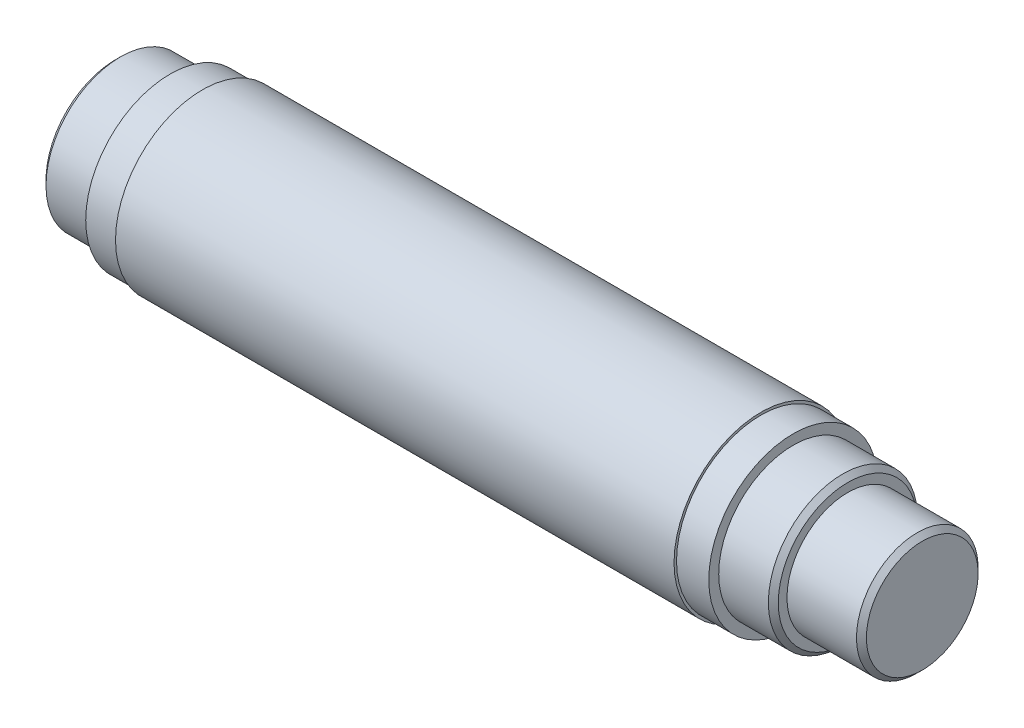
ISO-10303-21;
HEADER;
FILE_DESCRIPTION(('STEP AP214'),'2;1');
FILE_NAME('part.step','',(''),(''),'','','');
FILE_SCHEMA(('AUTOMOTIVE_DESIGN { 1 0 10303 214 1 1 1 1 }'));
ENDSEC;
DATA;
#1=APPLICATION_CONTEXT('core data for automotive mechanical design processes');
#2=APPLICATION_PROTOCOL_DEFINITION('international standard','automotive_design',2000,#1);
#3=PRODUCT_CONTEXT('',#1,'mechanical');
#4=PRODUCT('Part','Part','',(#3));
#5=PRODUCT_RELATED_PRODUCT_CATEGORY('part','',(#4));
#6=PRODUCT_DEFINITION_FORMATION('','',#4);
#7=PRODUCT_DEFINITION_CONTEXT('part definition',#1,'design');
#8=PRODUCT_DEFINITION('design','',#6,#7);
#9=PRODUCT_DEFINITION_SHAPE('','',#8);
#10=(LENGTH_UNIT() NAMED_UNIT(*) SI_UNIT(.MILLI.,.METRE.));
#11=(NAMED_UNIT(*) PLANE_ANGLE_UNIT() SI_UNIT($,.RADIAN.));
#12=(NAMED_UNIT(*) SI_UNIT($,.STERADIAN.) SOLID_ANGLE_UNIT());
#13=UNCERTAINTY_MEASURE_WITH_UNIT(LENGTH_MEASURE(1.E-05),#10,'distance_accuracy_value','');
#14=(GEOMETRIC_REPRESENTATION_CONTEXT(3) GLOBAL_UNCERTAINTY_ASSIGNED_CONTEXT((#13)) GLOBAL_UNIT_ASSIGNED_CONTEXT((#10,
#11,#12)) REPRESENTATION_CONTEXT('',''));
#15=CARTESIAN_POINT('',(0.,0.,0.));
#16=DIRECTION('',(0.,0.,1.));
#17=DIRECTION('',(1.,0.,0.));
#18=AXIS2_PLACEMENT_3D('',#15,#16,#17);
#19=CARTESIAN_POINT('',(0.,0.,0.));
#20=DIRECTION('',(1.,0.,0.));
#21=DIRECTION('',(0.,0.,-1.));
#22=AXIS2_PLACEMENT_3D('',#19,#20,#21);
#23=PLANE('',#22);
#24=CARTESIAN_POINT('',(0.,0.,0.));
#25=DIRECTION('',(1.,0.,0.));
#26=DIRECTION('',(0.,0.,-1.));
#27=AXIS2_PLACEMENT_3D('',#24,#25,#26);
#28=CIRCLE('',#27,28.);
#29=CARTESIAN_POINT('',(0.,0.,-28.));
#30=VERTEX_POINT('',#29);
#31=EDGE_CURVE('E116',#30,#30,#28,.F.);
#32=ORIENTED_EDGE('',*,*,#31,.T.);
#33=EDGE_LOOP('',(#32));
#34=FACE_BOUND('',#33,.T.);
#35=ADVANCED_FACE('F109',(#34),#23,.F.);
#36=CARTESIAN_POINT('',(-63.6783707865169,0.,0.));
#37=DIRECTION('',(-1.,0.,0.));
#38=DIRECTION('',(0.,0.,1.));
#39=AXIS2_PLACEMENT_3D('',#36,#37,#38);
#40=CYLINDRICAL_SURFACE('',#39,30.);
#41=CARTESIAN_POINT('',(1.99999999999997,0.,0.));
#42=DIRECTION('',(1.,0.,0.));
#43=DIRECTION('',(0.,0.,-1.));
#44=AXIS2_PLACEMENT_3D('',#41,#42,#43);
#45=CIRCLE('',#44,30.);
#46=CARTESIAN_POINT('',(1.99999999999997,0.,-30.));
#47=VERTEX_POINT('',#46);
#48=EDGE_CURVE('E11',#47,#47,#45,.T.);
#49=ORIENTED_EDGE('',*,*,#48,.T.);
#50=EDGE_LOOP('',(#49));
#51=FACE_BOUND('',#50,.T.);
#52=CARTESIAN_POINT('',(22.,0.,0.));
#53=DIRECTION('',(-1.,0.,0.));
#54=DIRECTION('',(0.,0.,1.));
#55=AXIS2_PLACEMENT_3D('',#52,#53,#54);
#56=CIRCLE('',#55,30.);
#57=CARTESIAN_POINT('',(22.,0.,30.));
#58=VERTEX_POINT('',#57);
#59=EDGE_CURVE('E135',#58,#58,#56,.T.);
#60=ORIENTED_EDGE('',*,*,#59,.T.);
#61=EDGE_LOOP('',(#60));
#62=FACE_BOUND('',#61,.T.);
#63=ADVANCED_FACE('F184',(#51,#62),#40,.T.);
#64=CARTESIAN_POINT('',(22.,30.,0.));
#65=DIRECTION('',(1.,0.,0.));
#66=DIRECTION('',(0.,0.,-1.));
#67=AXIS2_PLACEMENT_3D('',#64,#65,#66);
#68=PLANE('',#67);
#69=ORIENTED_EDGE('',*,*,#59,.F.);
#70=EDGE_LOOP('',(#69));
#71=FACE_BOUND('',#70,.T.);
#72=CARTESIAN_POINT('',(22.,0.,0.));
#73=DIRECTION('',(-1.,0.,0.));
#74=DIRECTION('',(0.,0.,1.));
#75=AXIS2_PLACEMENT_3D('',#72,#73,#74);
#76=CIRCLE('',#75,34.);
#77=CARTESIAN_POINT('',(22.,0.,34.));
#78=VERTEX_POINT('',#77);
#79=EDGE_CURVE('E138',#78,#78,#76,.T.);
#80=ORIENTED_EDGE('',*,*,#79,.T.);
#81=EDGE_LOOP('',(#80));
#82=FACE_BOUND('',#81,.T.);
#83=ADVANCED_FACE('F190',(#71,#82),#68,.F.);
#84=CARTESIAN_POINT('',(-63.6783707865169,0.,0.));
#85=DIRECTION('',(-1.,0.,0.));
#86=DIRECTION('',(0.,0.,1.));
#87=AXIS2_PLACEMENT_3D('',#84,#85,#86);
#88=CYLINDRICAL_SURFACE('',#87,34.);
#89=ORIENTED_EDGE('',*,*,#79,.F.);
#90=EDGE_LOOP('',(#89));
#91=FACE_BOUND('',#90,.T.);
#92=CARTESIAN_POINT('',(35.,0.,0.));
#93=DIRECTION('',(-1.,0.,0.));
#94=DIRECTION('',(0.,0.,1.));
#95=AXIS2_PLACEMENT_3D('',#92,#93,#94);
#96=CIRCLE('',#95,34.);
#97=CARTESIAN_POINT('',(35.,0.,34.));
#98=VERTEX_POINT('',#97);
#99=EDGE_CURVE('E141',#98,#98,#96,.T.);
#100=ORIENTED_EDGE('',*,*,#99,.T.);
#101=EDGE_LOOP('',(#100));
#102=FACE_BOUND('',#101,.T.);
#103=ADVANCED_FACE('F274',(#91,#102),#88,.T.);
#104=CARTESIAN_POINT('',(35.,34.,0.));
#105=DIRECTION('',(1.,0.,0.));
#106=DIRECTION('',(0.,0.,-1.));
#107=AXIS2_PLACEMENT_3D('',#104,#105,#106);
#108=PLANE('',#107);
#109=ORIENTED_EDGE('',*,*,#99,.F.);
#110=EDGE_LOOP('',(#109));
#111=FACE_BOUND('',#110,.T.);
#112=CARTESIAN_POINT('',(35.,0.,0.));
#113=DIRECTION('',(-1.,0.,0.));
#114=DIRECTION('',(0.,0.,1.));
#115=AXIS2_PLACEMENT_3D('',#112,#113,#114);
#116=CIRCLE('',#115,35.);
#117=CARTESIAN_POINT('',(35.,0.,35.));
#118=VERTEX_POINT('',#117);
#119=EDGE_CURVE('E144',#118,#118,#116,.T.);
#120=ORIENTED_EDGE('',*,*,#119,.T.);
#121=EDGE_LOOP('',(#120));
#122=FACE_BOUND('',#121,.T.);
#123=ADVANCED_FACE('F266',(#111,#122),#108,.F.);
#124=CARTESIAN_POINT('',(-63.6783707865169,0.,0.));
#125=DIRECTION('',(-1.,0.,0.));
#126=DIRECTION('',(0.,0.,1.));
#127=AXIS2_PLACEMENT_3D('',#124,#125,#126);
#128=CYLINDRICAL_SURFACE('',#127,35.);
#129=ORIENTED_EDGE('',*,*,#119,.F.);
#130=EDGE_LOOP('',(#129));
#131=FACE_BOUND('',#130,.T.);
#132=CARTESIAN_POINT('',(260.,0.,0.));
#133=DIRECTION('',(-1.,0.,0.));
#134=DIRECTION('',(0.,0.,1.));
#135=AXIS2_PLACEMENT_3D('',#132,#133,#134);
#136=CIRCLE('',#135,35.);
#137=CARTESIAN_POINT('',(260.,0.,35.));
#138=VERTEX_POINT('',#137);
#139=EDGE_CURVE('E147',#138,#138,#136,.T.);
#140=ORIENTED_EDGE('',*,*,#139,.T.);
#141=EDGE_LOOP('',(#140));
#142=FACE_BOUND('',#141,.T.);
#143=ADVANCED_FACE('F258',(#131,#142),#128,.T.);
#144=CARTESIAN_POINT('',(260.,35.,0.));
#145=DIRECTION('',(-1.,0.,0.));
#146=DIRECTION('',(0.,0.,1.));
#147=AXIS2_PLACEMENT_3D('',#144,#145,#146);
#148=PLANE('',#147);
#149=ORIENTED_EDGE('',*,*,#139,.F.);
#150=EDGE_LOOP('',(#149));
#151=FACE_BOUND('',#150,.T.);
#152=CARTESIAN_POINT('',(260.,0.,0.));
#153=DIRECTION('',(-1.,0.,0.));
#154=DIRECTION('',(0.,0.,1.));
#155=AXIS2_PLACEMENT_3D('',#152,#153,#154);
#156=CIRCLE('',#155,34.);
#157=CARTESIAN_POINT('',(260.,0.,34.));
#158=VERTEX_POINT('',#157);
#159=EDGE_CURVE('E150',#158,#158,#156,.T.);
#160=ORIENTED_EDGE('',*,*,#159,.T.);
#161=EDGE_LOOP('',(#160));
#162=FACE_BOUND('',#161,.T.);
#163=ADVANCED_FACE('F250',(#151,#162),#148,.F.);
#164=CARTESIAN_POINT('',(-63.6783707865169,0.,0.));
#165=DIRECTION('',(-1.,0.,0.));
#166=DIRECTION('',(0.,0.,1.));
#167=AXIS2_PLACEMENT_3D('',#164,#165,#166);
#168=CYLINDRICAL_SURFACE('',#167,34.);
#169=ORIENTED_EDGE('',*,*,#159,.F.);
#170=EDGE_LOOP('',(#169));
#171=FACE_BOUND('',#170,.T.);
#172=CARTESIAN_POINT('',(273.,0.,0.));
#173=DIRECTION('',(-1.,0.,0.));
#174=DIRECTION('',(0.,0.,1.));
#175=AXIS2_PLACEMENT_3D('',#172,#173,#174);
#176=CIRCLE('',#175,34.);
#177=CARTESIAN_POINT('',(273.,0.,34.));
#178=VERTEX_POINT('',#177);
#179=EDGE_CURVE('E153',#178,#178,#176,.T.);
#180=ORIENTED_EDGE('',*,*,#179,.T.);
#181=EDGE_LOOP('',(#180));
#182=FACE_BOUND('',#181,.T.);
#183=ADVANCED_FACE('F242',(#171,#182),#168,.T.);
#184=CARTESIAN_POINT('',(273.,34.,0.));
#185=DIRECTION('',(-1.,0.,0.));
#186=DIRECTION('',(0.,0.,1.));
#187=AXIS2_PLACEMENT_3D('',#184,#185,#186);
#188=PLANE('',#187);
#189=ORIENTED_EDGE('',*,*,#179,.F.);
#190=EDGE_LOOP('',(#189));
#191=FACE_BOUND('',#190,.T.);
#192=CARTESIAN_POINT('',(273.,0.,0.));
#193=DIRECTION('',(-1.,0.,0.));
#194=DIRECTION('',(0.,0.,1.));
#195=AXIS2_PLACEMENT_3D('',#192,#193,#194);
#196=CIRCLE('',#195,30.);
#197=CARTESIAN_POINT('',(273.,0.,30.));
#198=VERTEX_POINT('',#197);
#199=EDGE_CURVE('E156',#198,#198,#196,.T.);
#200=ORIENTED_EDGE('',*,*,#199,.T.);
#201=EDGE_LOOP('',(#200));
#202=FACE_BOUND('',#201,.T.);
#203=ADVANCED_FACE('F179',(#191,#202),#188,.F.);
#204=CARTESIAN_POINT('',(-63.6783707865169,0.,0.));
#205=DIRECTION('',(-1.,0.,0.));
#206=DIRECTION('',(0.,0.,1.));
#207=AXIS2_PLACEMENT_3D('',#204,#205,#206);
#208=CYLINDRICAL_SURFACE('',#207,30.);
#209=CARTESIAN_POINT('',(293.,0.,0.));
#210=DIRECTION('',(-1.,0.,0.));
#211=DIRECTION('',(0.,0.,1.));
#212=AXIS2_PLACEMENT_3D('',#209,#210,#211);
#213=CIRCLE('',#212,30.);
#214=CARTESIAN_POINT('',(293.,0.,30.));
#215=VERTEX_POINT('',#214);
#216=EDGE_CURVE('E132',#215,#215,#213,.T.);
#217=ORIENTED_EDGE('',*,*,#216,.T.);
#218=EDGE_LOOP('',(#217));
#219=FACE_BOUND('',#218,.T.);
#220=ORIENTED_EDGE('',*,*,#199,.F.);
#221=EDGE_LOOP('',(#220));
#222=FACE_BOUND('',#221,.T.);
#223=ADVANCED_FACE('F168',(#219,#222),#208,.T.);
#224=CARTESIAN_POINT('',(295.,30.,0.));
#225=DIRECTION('',(-1.,0.,0.));
#226=DIRECTION('',(0.,0.,1.));
#227=AXIS2_PLACEMENT_3D('',#224,#225,#226);
#228=PLANE('',#227);
#229=CARTESIAN_POINT('',(295.,0.,0.));
#230=DIRECTION('',(-1.,0.,0.));
#231=DIRECTION('',(0.,0.,1.));
#232=AXIS2_PLACEMENT_3D('',#229,#230,#231);
#233=CIRCLE('',#232,28.);
#234=CARTESIAN_POINT('',(295.,0.,28.));
#235=VERTEX_POINT('',#234);
#236=EDGE_CURVE('E129',#235,#235,#233,.F.);
#237=ORIENTED_EDGE('',*,*,#236,.T.);
#238=EDGE_LOOP('',(#237));
#239=FACE_BOUND('',#238,.T.);
#240=CARTESIAN_POINT('',(295.,0.,0.));
#241=DIRECTION('',(-1.,0.,0.));
#242=DIRECTION('',(0.,0.,1.));
#243=AXIS2_PLACEMENT_3D('',#240,#241,#242);
#244=CIRCLE('',#243,24.5);
#245=CARTESIAN_POINT('',(295.,0.,24.5));
#246=VERTEX_POINT('',#245);
#247=EDGE_CURVE('E159',#246,#246,#244,.F.);
#248=ORIENTED_EDGE('',*,*,#247,.F.);
#249=EDGE_LOOP('',(#248));
#250=FACE_BOUND('',#249,.T.);
#251=ADVANCED_FACE('F165',(#239,#250),#228,.F.);
#252=CARTESIAN_POINT('',(293.,0.,0.));
#253=DIRECTION('',(-1.,0.,0.));
#254=DIRECTION('',(0.,0.,1.));
#255=AXIS2_PLACEMENT_3D('',#252,#253,#254);
#256=CONICAL_SURFACE('',#255,30.,0.78539816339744);
#257=ORIENTED_EDGE('',*,*,#236,.F.);
#258=EDGE_LOOP('',(#257));
#259=FACE_BOUND('',#258,.T.);
#260=ORIENTED_EDGE('',*,*,#216,.F.);
#261=EDGE_LOOP('',(#260));
#262=FACE_BOUND('',#261,.T.);
#263=ADVANCED_FACE('F167',(#259,#262),#256,.T.);
#264=CARTESIAN_POINT('',(0.,0.,0.));
#265=DIRECTION('',(1.,0.,0.));
#266=DIRECTION('',(0.,0.,-1.));
#267=AXIS2_PLACEMENT_3D('',#264,#265,#266);
#268=CONICAL_SURFACE('',#267,28.,0.785398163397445);
#269=ORIENTED_EDGE('',*,*,#48,.F.);
#270=EDGE_LOOP('',(#269));
#271=FACE_BOUND('',#270,.T.);
#272=ORIENTED_EDGE('',*,*,#31,.F.);
#273=EDGE_LOOP('',(#272));
#274=FACE_BOUND('',#273,.T.);
#275=ADVANCED_FACE('F111',(#271,#274),#268,.T.);
#276=CARTESIAN_POINT('',(325.,24.5,0.));
#277=DIRECTION('',(-1.,0.,0.));
#278=DIRECTION('',(0.,0.,1.));
#279=AXIS2_PLACEMENT_3D('',#276,#277,#278);
#280=PLANE('',#279);
#281=CARTESIAN_POINT('',(325.,0.,0.));
#282=DIRECTION('',(-1.,0.,0.));
#283=DIRECTION('',(0.,0.,1.));
#284=AXIS2_PLACEMENT_3D('',#281,#282,#283);
#285=CIRCLE('',#284,22.5);
#286=CARTESIAN_POINT('',(325.,0.,22.5));
#287=VERTEX_POINT('',#286);
#288=EDGE_CURVE('E120',#287,#287,#285,.F.);
#289=ORIENTED_EDGE('',*,*,#288,.T.);
#290=EDGE_LOOP('',(#289));
#291=FACE_BOUND('',#290,.T.);
#292=ADVANCED_FACE('F195',(#291),#280,.F.);
#293=CARTESIAN_POINT('',(323.,0.,0.));
#294=DIRECTION('',(-1.,0.,0.));
#295=DIRECTION('',(0.,0.,1.));
#296=AXIS2_PLACEMENT_3D('',#293,#294,#295);
#297=CONICAL_SURFACE('',#296,24.5,0.785398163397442);
#298=ORIENTED_EDGE('',*,*,#288,.F.);
#299=EDGE_LOOP('',(#298));
#300=FACE_BOUND('',#299,.T.);
#301=CARTESIAN_POINT('',(323.,0.,0.));
#302=DIRECTION('',(-1.,0.,0.));
#303=DIRECTION('',(0.,0.,1.));
#304=AXIS2_PLACEMENT_3D('',#301,#302,#303);
#305=CIRCLE('',#304,24.5);
#306=CARTESIAN_POINT('',(323.,0.,24.5));
#307=VERTEX_POINT('',#306);
#308=EDGE_CURVE('E124',#307,#307,#305,.T.);
#309=ORIENTED_EDGE('',*,*,#308,.F.);
#310=EDGE_LOOP('',(#309));
#311=FACE_BOUND('',#310,.T.);
#312=ADVANCED_FACE('F193',(#300,#311),#297,.T.);
#313=CARTESIAN_POINT('',(-63.6783707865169,0.,0.));
#314=DIRECTION('',(-1.,0.,0.));
#315=DIRECTION('',(0.,0.,1.));
#316=AXIS2_PLACEMENT_3D('',#313,#314,#315);
#317=CYLINDRICAL_SURFACE('',#316,24.5);
#318=ORIENTED_EDGE('',*,*,#308,.T.);
#319=EDGE_LOOP('',(#318));
#320=FACE_BOUND('',#319,.T.);
#321=ORIENTED_EDGE('',*,*,#247,.T.);
#322=EDGE_LOOP('',(#321));
#323=FACE_BOUND('',#322,.T.);
#324=ADVANCED_FACE('F163',(#320,#323),#317,.T.);
#325=CLOSED_SHELL('',(#35,#63,#83,#103,#123,#143,#163,#183,#203,#223,#251,#263,#275,#292,#312,#324));
#326=MANIFOLD_SOLID_BREP('B2',#325);
#327=ADVANCED_BREP_SHAPE_REPRESENTATION('',(#18,#326),#14);
#328=SHAPE_DEFINITION_REPRESENTATION(#9,#327);
ENDSEC;
END-ISO-10303-21;
